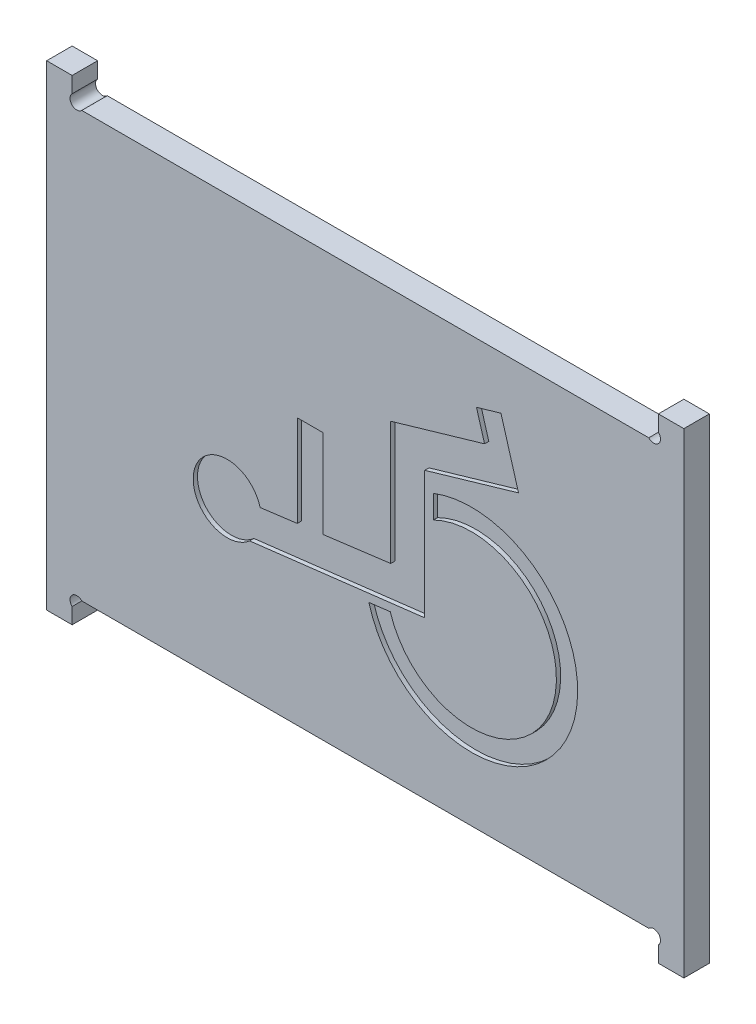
from build123d import *

# Parameters (mm, degrees)
BASE_EXTRUSION_DEPTH    = 6
ENL_V_MAT_EXTRU_1_DEPTH = 1
ENL_V_START             = -6
ESQUISSE3_R             = 1.6
ENL_V_MAT_EXTRU_2_DEPTH = 6


with BuildPart() as part:
    # Esquisse1 → Base-Extrusion (new body)
    with BuildSketch(Plane.XY):
        Polygon((99.759098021, 29.403121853), (99.759098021, 35.403121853), (105.759098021, 35.403121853), (105.759098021, -40.404702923), (105.759098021, -70.596878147), (105.759098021, -76.596878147), (99.759098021, -76.596878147), (99.759098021, -70.596878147), (-38.240901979, -70.596878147), (-38.240901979, -76.596878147), (-44.240901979, -76.596878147), (-44.240901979, -70.596878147), (-44.240901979, 29.403121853), (-44.240901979, 35.403121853), (-38.240901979, 35.403121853), (-38.240901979, 29.403121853), align=None)
    extrude(amount=BASE_EXTRUSION_DEPTH)

    # Esquisse2 → Enl_v. mat.-Extru.1 (cut)
    with BuildSketch(Plane.XY.offset(6)):
        with BuildLine():
            Line((3.550600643, -38.596878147), (44.759098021, -33.671020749))
            Line((44.759098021, -33.671020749), (44.759098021, -11.231961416))
            Line((44.759098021, -11.231961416), (44.759098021, -3.596878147))
            Line((44.759098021, -3.596878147), (66.839098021, 2.843121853))
            Line((66.839098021, 2.843121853), (62.704505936, 17.018866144))
            Line((62.704505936, 17.018866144), (56.944505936, 15.338866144))
            Line((56.944505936, 15.338866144), (58.839098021, 8.843121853))
            Line((58.839098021, 8.843121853), (36.759098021, 2.403121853))
            Line((36.759098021, 2.403121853), (36.759098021, -4.607187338))
            Line((36.759098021, -4.607187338), (36.759098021, -26.596878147))
            Line((36.759098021, -26.596878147), (20.759098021, -28.657245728))
            Line((20.759098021, -28.657245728), (20.759098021, -7.889185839))
            Line((20.759098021, -7.889185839), (14.759098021, -7.889185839))
            Line((14.759098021, -7.889185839), (14.759098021, -29.42988357))
            Line((14.759098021, -29.42988357), (5.995042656, -30.558457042))
            ThreePointArc((5.995042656, -30.558457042), (-9.394832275, -30.269357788), (3.550600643, -38.596878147))
        make_face()
        with BuildLine():
            Line((31.620290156, -37.102103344), (36.643582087, -36.4788039))
            ThreePointArc((36.643582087, -36.4788039), (74.155628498, -38.443384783), (46.77330638, -12.729154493))
            Line((46.77330638, -12.729154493), (46.77330638, -7.267592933))
            ThreePointArc((46.77330638, -7.267592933), (78.048877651, -41.917908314), (31.620290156, -37.102103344))
        make_face()
    extrude(amount=-ENL_V_MAT_EXTRU_1_DEPTH, mode=Mode.SUBTRACT)

    # Esquisse3 → Enl_v. mat.-Extru.2 (cut)
    with BuildSketch(Plane.XY.offset(6).offset(ENL_V_START)):
        with Locations((-37.140901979, -71.696878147)):
            Circle(ESQUISSE3_R)
        with Locations((98.659098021, -71.696878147)):
            Circle(ESQUISSE3_R)
        with Locations((98.659098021, 30.503121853)):
            Circle(ESQUISSE3_R)
        with Locations((-37.140901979, 30.503121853)):
            Circle(ESQUISSE3_R)
    extrude(amount=ENL_V_MAT_EXTRU_2_DEPTH, mode=Mode.SUBTRACT)


solid = part.part
